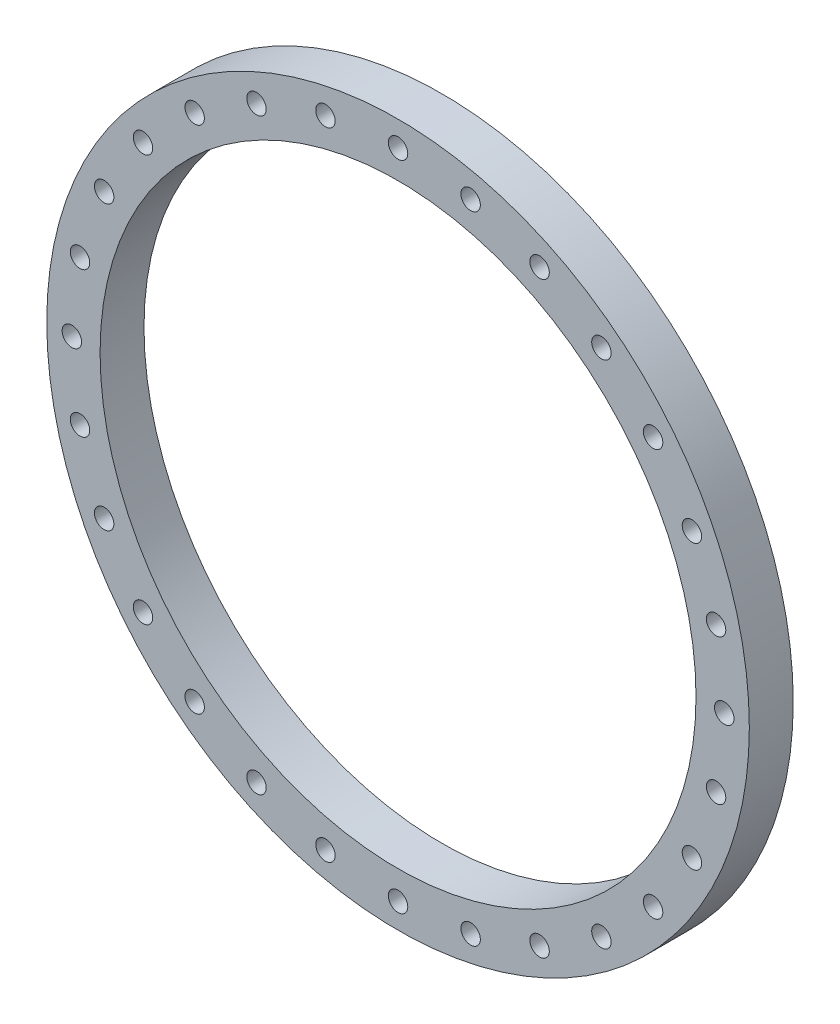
ISO-10303-21;
HEADER;
FILE_DESCRIPTION(('STEP AP214'),'2;1');
FILE_NAME('part.step','',(''),(''),'','','');
FILE_SCHEMA(('AUTOMOTIVE_DESIGN { 1 0 10303 214 1 1 1 1 }'));
ENDSEC;
DATA;
#1=APPLICATION_CONTEXT('core data for automotive mechanical design processes');
#2=APPLICATION_PROTOCOL_DEFINITION('international standard','automotive_design',2000,#1);
#3=PRODUCT_CONTEXT('',#1,'mechanical');
#4=PRODUCT('Part','Part','',(#3));
#5=PRODUCT_RELATED_PRODUCT_CATEGORY('part','',(#4));
#6=PRODUCT_DEFINITION_FORMATION('','',#4);
#7=PRODUCT_DEFINITION_CONTEXT('part definition',#1,'design');
#8=PRODUCT_DEFINITION('design','',#6,#7);
#9=PRODUCT_DEFINITION_SHAPE('','',#8);
#10=(LENGTH_UNIT() NAMED_UNIT(*) SI_UNIT(.MILLI.,.METRE.));
#11=(NAMED_UNIT(*) PLANE_ANGLE_UNIT() SI_UNIT($,.RADIAN.));
#12=(NAMED_UNIT(*) SI_UNIT($,.STERADIAN.) SOLID_ANGLE_UNIT());
#13=UNCERTAINTY_MEASURE_WITH_UNIT(LENGTH_MEASURE(1.E-05),#10,'distance_accuracy_value','');
#14=(GEOMETRIC_REPRESENTATION_CONTEXT(3) GLOBAL_UNCERTAINTY_ASSIGNED_CONTEXT((#13)) GLOBAL_UNIT_ASSIGNED_CONTEXT((#10,
#11,#12)) REPRESENTATION_CONTEXT('',''));
#15=CARTESIAN_POINT('',(0.,0.,0.));
#16=DIRECTION('',(0.,0.,1.));
#17=DIRECTION('',(1.,0.,0.));
#18=AXIS2_PLACEMENT_3D('',#15,#16,#17);
#19=CARTESIAN_POINT('',(0.,0.,0.));
#20=DIRECTION('',(0.,0.,1.));
#21=DIRECTION('',(1.,0.,0.));
#22=AXIS2_PLACEMENT_3D('',#19,#20,#21);
#23=PLANE('',#22);
#24=CARTESIAN_POINT('',(-11.5710885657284,50.6962514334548,0.));
#25=DIRECTION('',(0.,0.,1.));
#26=DIRECTION('',(1.,0.,0.));
#27=AXIS2_PLACEMENT_3D('',#24,#25,#26);
#28=CIRCLE('',#27,1.55);
#29=CARTESIAN_POINT('',(-10.0210885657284,50.6962514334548,0.));
#30=VERTEX_POINT('',#29);
#31=EDGE_CURVE('E169',#30,#30,#28,.T.);
#32=ORIENTED_EDGE('',*,*,#31,.T.);
#33=EDGE_LOOP('',(#32));
#34=FACE_BOUND('',#33,.T.);
#35=CARTESIAN_POINT('',(-22.5619544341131,46.8503811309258,0.));
#36=DIRECTION('',(0.,0.,1.));
#37=DIRECTION('',(1.,0.,0.));
#38=AXIS2_PLACEMENT_3D('',#35,#36,#37);
#39=CIRCLE('',#38,1.55);
#40=CARTESIAN_POINT('',(-21.0119544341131,46.8503811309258,0.));
#41=VERTEX_POINT('',#40);
#42=EDGE_CURVE('E184',#41,#41,#39,.T.);
#43=ORIENTED_EDGE('',*,*,#42,.T.);
#44=EDGE_LOOP('',(#43));
#45=FACE_BOUND('',#44,.T.);
#46=CARTESIAN_POINT('',(-32.4214696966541,40.6552370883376,0.));
#47=DIRECTION('',(0.,0.,1.));
#48=DIRECTION('',(1.,0.,0.));
#49=AXIS2_PLACEMENT_3D('',#46,#47,#48);
#50=CIRCLE('',#49,1.55);
#51=CARTESIAN_POINT('',(-30.8714696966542,40.6552370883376,0.));
#52=VERTEX_POINT('',#51);
#53=EDGE_CURVE('E192',#52,#52,#50,.T.);
#54=ORIENTED_EDGE('',*,*,#53,.T.);
#55=EDGE_LOOP('',(#54));
#56=FACE_BOUND('',#55,.T.);
#57=CARTESIAN_POINT('',(-40.6552370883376,32.4214696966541,0.));
#58=DIRECTION('',(0.,0.,1.));
#59=DIRECTION('',(1.,0.,0.));
#60=AXIS2_PLACEMENT_3D('',#57,#58,#59);
#61=CIRCLE('',#60,1.55);
#62=CARTESIAN_POINT('',(-39.1052370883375,32.4214696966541,0.));
#63=VERTEX_POINT('',#62);
#64=EDGE_CURVE('E203',#63,#63,#61,.T.);
#65=ORIENTED_EDGE('',*,*,#64,.T.);
#66=EDGE_LOOP('',(#65));
#67=FACE_BOUND('',#66,.T.);
#68=CARTESIAN_POINT('',(-46.8503811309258,22.561954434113,0.));
#69=DIRECTION('',(0.,0.,1.));
#70=DIRECTION('',(1.,0.,0.));
#71=AXIS2_PLACEMENT_3D('',#68,#69,#70);
#72=CIRCLE('',#71,1.55);
#73=CARTESIAN_POINT('',(-45.3003811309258,22.561954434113,0.));
#74=VERTEX_POINT('',#73);
#75=EDGE_CURVE('E214',#74,#74,#72,.T.);
#76=ORIENTED_EDGE('',*,*,#75,.T.);
#77=EDGE_LOOP('',(#76));
#78=FACE_BOUND('',#77,.T.);
#79=CARTESIAN_POINT('',(-50.6962514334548,11.5710885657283,0.));
#80=DIRECTION('',(0.,0.,1.));
#81=DIRECTION('',(1.,0.,0.));
#82=AXIS2_PLACEMENT_3D('',#79,#80,#81);
#83=CIRCLE('',#82,1.55);
#84=CARTESIAN_POINT('',(-49.1462514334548,11.5710885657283,0.));
#85=VERTEX_POINT('',#84);
#86=EDGE_CURVE('E234',#85,#85,#83,.T.);
#87=ORIENTED_EDGE('',*,*,#86,.T.);
#88=EDGE_LOOP('',(#87));
#89=FACE_BOUND('',#88,.T.);
#90=CARTESIAN_POINT('',(-52.,0.,0.));
#91=DIRECTION('',(0.,0.,1.));
#92=DIRECTION('',(1.,0.,0.));
#93=AXIS2_PLACEMENT_3D('',#90,#91,#92);
#94=CIRCLE('',#93,1.55);
#95=CARTESIAN_POINT('',(-50.45,0.,0.));
#96=VERTEX_POINT('',#95);
#97=EDGE_CURVE('E239',#96,#96,#94,.T.);
#98=ORIENTED_EDGE('',*,*,#97,.T.);
#99=EDGE_LOOP('',(#98));
#100=FACE_BOUND('',#99,.T.);
#101=CARTESIAN_POINT('',(-50.6962514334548,-11.5710885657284,0.));
#102=DIRECTION('',(0.,0.,1.));
#103=DIRECTION('',(1.,0.,0.));
#104=AXIS2_PLACEMENT_3D('',#101,#102,#103);
#105=CIRCLE('',#104,1.55);
#106=CARTESIAN_POINT('',(-49.1462514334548,-11.5710885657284,0.));
#107=VERTEX_POINT('',#106);
#108=EDGE_CURVE('E252',#107,#107,#105,.T.);
#109=ORIENTED_EDGE('',*,*,#108,.T.);
#110=EDGE_LOOP('',(#109));
#111=FACE_BOUND('',#110,.T.);
#112=CARTESIAN_POINT('',(-46.8503811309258,-22.5619544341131,0.));
#113=DIRECTION('',(0.,0.,1.));
#114=DIRECTION('',(1.,0.,0.));
#115=AXIS2_PLACEMENT_3D('',#112,#113,#114);
#116=CIRCLE('',#115,1.55);
#117=CARTESIAN_POINT('',(-45.3003811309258,-22.5619544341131,0.));
#118=VERTEX_POINT('',#117);
#119=EDGE_CURVE('E37',#118,#118,#116,.T.);
#120=ORIENTED_EDGE('',*,*,#119,.T.);
#121=EDGE_LOOP('',(#120));
#122=FACE_BOUND('',#121,.T.);
#123=CARTESIAN_POINT('',(-40.6552370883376,-32.4214696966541,0.));
#124=DIRECTION('',(0.,0.,1.));
#125=DIRECTION('',(1.,0.,0.));
#126=AXIS2_PLACEMENT_3D('',#123,#124,#125);
#127=CIRCLE('',#126,1.55);
#128=CARTESIAN_POINT('',(-39.1052370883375,-32.4214696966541,0.));
#129=VERTEX_POINT('',#128);
#130=EDGE_CURVE('E51',#129,#129,#127,.T.);
#131=ORIENTED_EDGE('',*,*,#130,.T.);
#132=EDGE_LOOP('',(#131));
#133=FACE_BOUND('',#132,.T.);
#134=CARTESIAN_POINT('',(-32.4214696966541,-40.6552370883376,0.));
#135=DIRECTION('',(0.,0.,1.));
#136=DIRECTION('',(1.,0.,0.));
#137=AXIS2_PLACEMENT_3D('',#134,#135,#136);
#138=CIRCLE('',#137,1.55);
#139=CARTESIAN_POINT('',(-30.8714696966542,-40.6552370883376,0.));
#140=VERTEX_POINT('',#139);
#141=EDGE_CURVE('E65',#140,#140,#138,.T.);
#142=ORIENTED_EDGE('',*,*,#141,.T.);
#143=EDGE_LOOP('',(#142));
#144=FACE_BOUND('',#143,.T.);
#145=CARTESIAN_POINT('',(-22.561954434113,-46.8503811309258,0.));
#146=DIRECTION('',(0.,0.,1.));
#147=DIRECTION('',(1.,0.,0.));
#148=AXIS2_PLACEMENT_3D('',#145,#146,#147);
#149=CIRCLE('',#148,1.55);
#150=CARTESIAN_POINT('',(-21.011954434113,-46.8503811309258,0.));
#151=VERTEX_POINT('',#150);
#152=EDGE_CURVE('E42',#151,#151,#149,.T.);
#153=ORIENTED_EDGE('',*,*,#152,.T.);
#154=EDGE_LOOP('',(#153));
#155=FACE_BOUND('',#154,.T.);
#156=CARTESIAN_POINT('',(-11.5710885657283,-50.6962514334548,0.));
#157=DIRECTION('',(0.,0.,1.));
#158=DIRECTION('',(1.,0.,0.));
#159=AXIS2_PLACEMENT_3D('',#156,#157,#158);
#160=CIRCLE('',#159,1.55);
#161=CARTESIAN_POINT('',(-10.0210885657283,-50.6962514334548,0.));
#162=VERTEX_POINT('',#161);
#163=EDGE_CURVE('E81',#162,#162,#160,.T.);
#164=ORIENTED_EDGE('',*,*,#163,.T.);
#165=EDGE_LOOP('',(#164));
#166=FACE_BOUND('',#165,.T.);
#167=CARTESIAN_POINT('',(0.,-52.,0.));
#168=DIRECTION('',(0.,0.,1.));
#169=DIRECTION('',(1.,0.,0.));
#170=AXIS2_PLACEMENT_3D('',#167,#168,#169);
#171=CIRCLE('',#170,1.55);
#172=CARTESIAN_POINT('',(1.55000000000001,-52.,0.));
#173=VERTEX_POINT('',#172);
#174=EDGE_CURVE('E86',#173,#173,#171,.T.);
#175=ORIENTED_EDGE('',*,*,#174,.T.);
#176=EDGE_LOOP('',(#175));
#177=FACE_BOUND('',#176,.T.);
#178=CARTESIAN_POINT('',(11.5710885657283,-50.6962514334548,0.));
#179=DIRECTION('',(0.,0.,1.));
#180=DIRECTION('',(1.,0.,0.));
#181=AXIS2_PLACEMENT_3D('',#178,#179,#180);
#182=CIRCLE('',#181,1.55);
#183=CARTESIAN_POINT('',(13.1210885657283,-50.6962514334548,0.));
#184=VERTEX_POINT('',#183);
#185=EDGE_CURVE('E91',#184,#184,#182,.T.);
#186=ORIENTED_EDGE('',*,*,#185,.T.);
#187=EDGE_LOOP('',(#186));
#188=FACE_BOUND('',#187,.T.);
#189=CARTESIAN_POINT('',(22.5619544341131,-46.8503811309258,0.));
#190=DIRECTION('',(0.,0.,1.));
#191=DIRECTION('',(1.,0.,0.));
#192=AXIS2_PLACEMENT_3D('',#189,#190,#191);
#193=CIRCLE('',#192,1.55);
#194=CARTESIAN_POINT('',(24.111954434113,-46.8503811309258,0.));
#195=VERTEX_POINT('',#194);
#196=EDGE_CURVE('E107',#195,#195,#193,.T.);
#197=ORIENTED_EDGE('',*,*,#196,.T.);
#198=EDGE_LOOP('',(#197));
#199=FACE_BOUND('',#198,.T.);
#200=CARTESIAN_POINT('',(32.4214696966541,-40.6552370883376,0.));
#201=DIRECTION('',(0.,0.,1.));
#202=DIRECTION('',(1.,0.,0.));
#203=AXIS2_PLACEMENT_3D('',#200,#201,#202);
#204=CIRCLE('',#203,1.55);
#205=CARTESIAN_POINT('',(33.9714696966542,-40.6552370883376,0.));
#206=VERTEX_POINT('',#205);
#207=EDGE_CURVE('E106',#206,#206,#204,.T.);
#208=ORIENTED_EDGE('',*,*,#207,.T.);
#209=EDGE_LOOP('',(#208));
#210=FACE_BOUND('',#209,.T.);
#211=CARTESIAN_POINT('',(40.6552370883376,-32.4214696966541,0.));
#212=DIRECTION('',(0.,0.,1.));
#213=DIRECTION('',(1.,0.,0.));
#214=AXIS2_PLACEMENT_3D('',#211,#212,#213);
#215=CIRCLE('',#214,1.55);
#216=CARTESIAN_POINT('',(42.2052370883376,-32.4214696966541,0.));
#217=VERTEX_POINT('',#216);
#218=EDGE_CURVE('E112',#217,#217,#215,.T.);
#219=ORIENTED_EDGE('',*,*,#218,.T.);
#220=EDGE_LOOP('',(#219));
#221=FACE_BOUND('',#220,.T.);
#222=CARTESIAN_POINT('',(46.8503811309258,-22.561954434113,0.));
#223=DIRECTION('',(0.,0.,1.));
#224=DIRECTION('',(1.,0.,0.));
#225=AXIS2_PLACEMENT_3D('',#222,#223,#224);
#226=CIRCLE('',#225,1.55);
#227=CARTESIAN_POINT('',(48.4003811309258,-22.561954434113,0.));
#228=VERTEX_POINT('',#227);
#229=EDGE_CURVE('E117',#228,#228,#226,.T.);
#230=ORIENTED_EDGE('',*,*,#229,.T.);
#231=EDGE_LOOP('',(#230));
#232=FACE_BOUND('',#231,.T.);
#233=CARTESIAN_POINT('',(50.6962514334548,-11.5710885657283,0.));
#234=DIRECTION('',(0.,0.,1.));
#235=DIRECTION('',(1.,0.,0.));
#236=AXIS2_PLACEMENT_3D('',#233,#234,#235);
#237=CIRCLE('',#236,1.55);
#238=CARTESIAN_POINT('',(52.2462514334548,-11.5710885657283,0.));
#239=VERTEX_POINT('',#238);
#240=EDGE_CURVE('E128',#239,#239,#237,.T.);
#241=ORIENTED_EDGE('',*,*,#240,.T.);
#242=EDGE_LOOP('',(#241));
#243=FACE_BOUND('',#242,.T.);
#244=CARTESIAN_POINT('',(52.,0.,0.));
#245=DIRECTION('',(0.,0.,1.));
#246=DIRECTION('',(1.,0.,0.));
#247=AXIS2_PLACEMENT_3D('',#244,#245,#246);
#248=CIRCLE('',#247,1.55);
#249=CARTESIAN_POINT('',(53.55,0.,0.));
#250=VERTEX_POINT('',#249);
#251=EDGE_CURVE('E136',#250,#250,#248,.T.);
#252=ORIENTED_EDGE('',*,*,#251,.T.);
#253=EDGE_LOOP('',(#252));
#254=FACE_BOUND('',#253,.T.);
#255=CARTESIAN_POINT('',(50.6962514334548,11.5710885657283,0.));
#256=DIRECTION('',(0.,0.,1.));
#257=DIRECTION('',(1.,0.,0.));
#258=AXIS2_PLACEMENT_3D('',#255,#256,#257);
#259=CIRCLE('',#258,1.55);
#260=CARTESIAN_POINT('',(52.2462514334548,11.5710885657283,0.));
#261=VERTEX_POINT('',#260);
#262=EDGE_CURVE('E66',#261,#261,#259,.T.);
#263=ORIENTED_EDGE('',*,*,#262,.T.);
#264=EDGE_LOOP('',(#263));
#265=FACE_BOUND('',#264,.T.);
#266=CARTESIAN_POINT('',(46.8503811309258,22.561954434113,0.));
#267=DIRECTION('',(0.,0.,1.));
#268=DIRECTION('',(1.,0.,0.));
#269=AXIS2_PLACEMENT_3D('',#266,#267,#268);
#270=CIRCLE('',#269,1.55);
#271=CARTESIAN_POINT('',(48.4003811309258,22.561954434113,0.));
#272=VERTEX_POINT('',#271);
#273=EDGE_CURVE('E57',#272,#272,#270,.T.);
#274=ORIENTED_EDGE('',*,*,#273,.T.);
#275=EDGE_LOOP('',(#274));
#276=FACE_BOUND('',#275,.T.);
#277=CARTESIAN_POINT('',(40.6552370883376,32.4214696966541,0.));
#278=DIRECTION('',(0.,0.,1.));
#279=DIRECTION('',(1.,0.,0.));
#280=AXIS2_PLACEMENT_3D('',#277,#278,#279);
#281=CIRCLE('',#280,1.55);
#282=CARTESIAN_POINT('',(42.2052370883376,32.4214696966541,0.));
#283=VERTEX_POINT('',#282);
#284=EDGE_CURVE('E56',#283,#283,#281,.T.);
#285=ORIENTED_EDGE('',*,*,#284,.T.);
#286=EDGE_LOOP('',(#285));
#287=FACE_BOUND('',#286,.T.);
#288=CARTESIAN_POINT('',(32.4214696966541,40.6552370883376,0.));
#289=DIRECTION('',(0.,0.,1.));
#290=DIRECTION('',(1.,0.,0.));
#291=AXIS2_PLACEMENT_3D('',#288,#289,#290);
#292=CIRCLE('',#291,1.55);
#293=CARTESIAN_POINT('',(33.9714696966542,40.6552370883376,0.));
#294=VERTEX_POINT('',#293);
#295=EDGE_CURVE('E122',#294,#294,#292,.T.);
#296=ORIENTED_EDGE('',*,*,#295,.T.);
#297=EDGE_LOOP('',(#296));
#298=FACE_BOUND('',#297,.T.);
#299=CARTESIAN_POINT('',(22.561954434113,46.8503811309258,0.));
#300=DIRECTION('',(0.,0.,1.));
#301=DIRECTION('',(1.,0.,0.));
#302=AXIS2_PLACEMENT_3D('',#299,#300,#301);
#303=CIRCLE('',#302,1.55);
#304=CARTESIAN_POINT('',(24.111954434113,46.8503811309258,0.));
#305=VERTEX_POINT('',#304);
#306=EDGE_CURVE('E140',#305,#305,#303,.T.);
#307=ORIENTED_EDGE('',*,*,#306,.T.);
#308=EDGE_LOOP('',(#307));
#309=FACE_BOUND('',#308,.T.);
#310=CARTESIAN_POINT('',(11.5710885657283,50.6962514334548,0.));
#311=DIRECTION('',(0.,0.,1.));
#312=DIRECTION('',(1.,0.,0.));
#313=AXIS2_PLACEMENT_3D('',#310,#311,#312);
#314=CIRCLE('',#313,1.55);
#315=CARTESIAN_POINT('',(13.1210885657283,50.6962514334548,0.));
#316=VERTEX_POINT('',#315);
#317=EDGE_CURVE('E153',#316,#316,#314,.T.);
#318=ORIENTED_EDGE('',*,*,#317,.T.);
#319=EDGE_LOOP('',(#318));
#320=FACE_BOUND('',#319,.T.);
#321=CARTESIAN_POINT('',(0.,52.,0.));
#322=DIRECTION('',(0.,0.,1.));
#323=DIRECTION('',(1.,0.,0.));
#324=AXIS2_PLACEMENT_3D('',#321,#322,#323);
#325=CIRCLE('',#324,1.55);
#326=CARTESIAN_POINT('',(1.55,52.,0.));
#327=VERTEX_POINT('',#326);
#328=EDGE_CURVE('E96',#327,#327,#325,.T.);
#329=ORIENTED_EDGE('',*,*,#328,.T.);
#330=EDGE_LOOP('',(#329));
#331=FACE_BOUND('',#330,.T.);
#332=CARTESIAN_POINT('',(0.,0.,0.));
#333=DIRECTION('',(0.,0.,1.));
#334=DIRECTION('',(1.,0.,0.));
#335=AXIS2_PLACEMENT_3D('',#332,#333,#334);
#336=CIRCLE('',#335,47.5);
#337=CARTESIAN_POINT('',(47.5,0.,0.));
#338=VERTEX_POINT('',#337);
#339=EDGE_CURVE('E32',#338,#338,#336,.T.);
#340=ORIENTED_EDGE('',*,*,#339,.T.);
#341=EDGE_LOOP('',(#340));
#342=FACE_BOUND('',#341,.T.);
#343=CARTESIAN_POINT('',(0.,0.,0.));
#344=DIRECTION('',(0.,0.,1.));
#345=DIRECTION('',(1.,0.,0.));
#346=AXIS2_PLACEMENT_3D('',#343,#344,#345);
#347=CIRCLE('',#346,56.);
#348=CARTESIAN_POINT('',(56.,0.,0.));
#349=VERTEX_POINT('',#348);
#350=EDGE_CURVE('E10',#349,#349,#347,.T.);
#351=ORIENTED_EDGE('',*,*,#350,.F.);
#352=EDGE_LOOP('',(#351));
#353=FACE_BOUND('',#352,.T.);
#354=ADVANCED_FACE('F15',(#34,#45,#56,#67,#78,#89,#100,#111,#122,#133,#144,#155,#166,#177,#188,
#199,#210,#221,#232,#243,#254,#265,#276,#287,#298,#309,#320,#331,#342,#353),#23,.F.);
#355=CARTESIAN_POINT('',(0.,0.,7.));
#356=DIRECTION('',(0.,0.,1.));
#357=DIRECTION('',(1.,0.,0.));
#358=AXIS2_PLACEMENT_3D('',#355,#356,#357);
#359=PLANE('',#358);
#360=CARTESIAN_POINT('',(-11.5710885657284,50.6962514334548,7.));
#361=DIRECTION('',(0.,0.,1.));
#362=DIRECTION('',(1.,0.,0.));
#363=AXIS2_PLACEMENT_3D('',#360,#361,#362);
#364=CIRCLE('',#363,1.55);
#365=CARTESIAN_POINT('',(-10.0210885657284,50.6962514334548,7.));
#366=VERTEX_POINT('',#365);
#367=EDGE_CURVE('E1209',#366,#366,#364,.T.);
#368=ORIENTED_EDGE('',*,*,#367,.F.);
#369=EDGE_LOOP('',(#368));
#370=FACE_BOUND('',#369,.T.);
#371=CARTESIAN_POINT('',(-32.4214696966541,40.6552370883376,7.));
#372=DIRECTION('',(0.,0.,1.));
#373=DIRECTION('',(1.,0.,0.));
#374=AXIS2_PLACEMENT_3D('',#371,#372,#373);
#375=CIRCLE('',#374,1.55);
#376=CARTESIAN_POINT('',(-30.8714696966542,40.6552370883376,7.));
#377=VERTEX_POINT('',#376);
#378=EDGE_CURVE('E188',#377,#377,#375,.T.);
#379=ORIENTED_EDGE('',*,*,#378,.F.);
#380=EDGE_LOOP('',(#379));
#381=FACE_BOUND('',#380,.T.);
#382=CARTESIAN_POINT('',(-46.8503811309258,22.561954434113,7.));
#383=DIRECTION('',(0.,0.,1.));
#384=DIRECTION('',(1.,0.,0.));
#385=AXIS2_PLACEMENT_3D('',#382,#383,#384);
#386=CIRCLE('',#385,1.55);
#387=CARTESIAN_POINT('',(-45.3003811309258,22.561954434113,7.));
#388=VERTEX_POINT('',#387);
#389=EDGE_CURVE('E207',#388,#388,#386,.T.);
#390=ORIENTED_EDGE('',*,*,#389,.F.);
#391=EDGE_LOOP('',(#390));
#392=FACE_BOUND('',#391,.T.);
#393=CARTESIAN_POINT('',(-52.,0.,7.));
#394=DIRECTION('',(0.,0.,1.));
#395=DIRECTION('',(1.,0.,0.));
#396=AXIS2_PLACEMENT_3D('',#393,#394,#395);
#397=CIRCLE('',#396,1.55);
#398=CARTESIAN_POINT('',(-50.45,0.,7.));
#399=VERTEX_POINT('',#398);
#400=EDGE_CURVE('E235',#399,#399,#397,.T.);
#401=ORIENTED_EDGE('',*,*,#400,.F.);
#402=EDGE_LOOP('',(#401));
#403=FACE_BOUND('',#402,.T.);
#404=CARTESIAN_POINT('',(-46.8503811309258,-22.5619544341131,7.));
#405=DIRECTION('',(0.,0.,1.));
#406=DIRECTION('',(1.,0.,0.));
#407=AXIS2_PLACEMENT_3D('',#404,#405,#406);
#408=CIRCLE('',#407,1.55);
#409=CARTESIAN_POINT('',(-45.3003811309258,-22.5619544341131,7.));
#410=VERTEX_POINT('',#409);
#411=EDGE_CURVE('E35',#410,#410,#408,.T.);
#412=ORIENTED_EDGE('',*,*,#411,.F.);
#413=EDGE_LOOP('',(#412));
#414=FACE_BOUND('',#413,.T.);
#415=CARTESIAN_POINT('',(-32.4214696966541,-40.6552370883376,7.));
#416=DIRECTION('',(0.,0.,1.));
#417=DIRECTION('',(1.,0.,0.));
#418=AXIS2_PLACEMENT_3D('',#415,#416,#417);
#419=CIRCLE('',#418,1.55);
#420=CARTESIAN_POINT('',(-30.8714696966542,-40.6552370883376,7.));
#421=VERTEX_POINT('',#420);
#422=EDGE_CURVE('E61',#421,#421,#419,.T.);
#423=ORIENTED_EDGE('',*,*,#422,.F.);
#424=EDGE_LOOP('',(#423));
#425=FACE_BOUND('',#424,.T.);
#426=CARTESIAN_POINT('',(-11.5710885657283,-50.6962514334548,7.));
#427=DIRECTION('',(0.,0.,1.));
#428=DIRECTION('',(1.,0.,0.));
#429=AXIS2_PLACEMENT_3D('',#426,#427,#428);
#430=CIRCLE('',#429,1.55);
#431=CARTESIAN_POINT('',(-10.0210885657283,-50.6962514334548,7.));
#432=VERTEX_POINT('',#431);
#433=EDGE_CURVE('E46',#432,#432,#430,.T.);
#434=ORIENTED_EDGE('',*,*,#433,.F.);
#435=EDGE_LOOP('',(#434));
#436=FACE_BOUND('',#435,.T.);
#437=CARTESIAN_POINT('',(11.5710885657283,-50.6962514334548,7.));
#438=DIRECTION('',(0.,0.,1.));
#439=DIRECTION('',(1.,0.,0.));
#440=AXIS2_PLACEMENT_3D('',#437,#438,#439);
#441=CIRCLE('',#440,1.55);
#442=CARTESIAN_POINT('',(13.1210885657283,-50.6962514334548,7.));
#443=VERTEX_POINT('',#442);
#444=EDGE_CURVE('E87',#443,#443,#441,.T.);
#445=ORIENTED_EDGE('',*,*,#444,.F.);
#446=EDGE_LOOP('',(#445));
#447=FACE_BOUND('',#446,.T.);
#448=CARTESIAN_POINT('',(32.4214696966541,-40.6552370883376,7.));
#449=DIRECTION('',(0.,0.,1.));
#450=DIRECTION('',(1.,0.,0.));
#451=AXIS2_PLACEMENT_3D('',#448,#449,#450);
#452=CIRCLE('',#451,1.55);
#453=CARTESIAN_POINT('',(33.9714696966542,-40.6552370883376,7.));
#454=VERTEX_POINT('',#453);
#455=EDGE_CURVE('E102',#454,#454,#452,.T.);
#456=ORIENTED_EDGE('',*,*,#455,.F.);
#457=EDGE_LOOP('',(#456));
#458=FACE_BOUND('',#457,.T.);
#459=CARTESIAN_POINT('',(46.8503811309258,-22.561954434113,7.));
#460=DIRECTION('',(0.,0.,1.));
#461=DIRECTION('',(1.,0.,0.));
#462=AXIS2_PLACEMENT_3D('',#459,#460,#461);
#463=CIRCLE('',#462,1.55);
#464=CARTESIAN_POINT('',(48.4003811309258,-22.561954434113,7.));
#465=VERTEX_POINT('',#464);
#466=EDGE_CURVE('E113',#465,#465,#463,.T.);
#467=ORIENTED_EDGE('',*,*,#466,.F.);
#468=EDGE_LOOP('',(#467));
#469=FACE_BOUND('',#468,.T.);
#470=CARTESIAN_POINT('',(52.,0.,7.));
#471=DIRECTION('',(0.,0.,1.));
#472=DIRECTION('',(1.,0.,0.));
#473=AXIS2_PLACEMENT_3D('',#470,#471,#472);
#474=CIRCLE('',#473,1.55);
#475=CARTESIAN_POINT('',(53.55,0.,7.));
#476=VERTEX_POINT('',#475);
#477=EDGE_CURVE('E132',#476,#476,#474,.T.);
#478=ORIENTED_EDGE('',*,*,#477,.F.);
#479=EDGE_LOOP('',(#478));
#480=FACE_BOUND('',#479,.T.);
#481=CARTESIAN_POINT('',(46.8503811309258,22.561954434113,7.));
#482=DIRECTION('',(0.,0.,1.));
#483=DIRECTION('',(1.,0.,0.));
#484=AXIS2_PLACEMENT_3D('',#481,#482,#483);
#485=CIRCLE('',#484,1.55);
#486=CARTESIAN_POINT('',(48.4003811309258,22.561954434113,7.));
#487=VERTEX_POINT('',#486);
#488=EDGE_CURVE('E70',#487,#487,#485,.T.);
#489=ORIENTED_EDGE('',*,*,#488,.F.);
#490=EDGE_LOOP('',(#489));
#491=FACE_BOUND('',#490,.T.);
#492=CARTESIAN_POINT('',(32.4214696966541,40.6552370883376,7.));
#493=DIRECTION('',(0.,0.,1.));
#494=DIRECTION('',(1.,0.,0.));
#495=AXIS2_PLACEMENT_3D('',#492,#493,#494);
#496=CIRCLE('',#495,1.55);
#497=CARTESIAN_POINT('',(33.9714696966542,40.6552370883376,7.));
#498=VERTEX_POINT('',#497);
#499=EDGE_CURVE('E127',#498,#498,#496,.T.);
#500=ORIENTED_EDGE('',*,*,#499,.F.);
#501=EDGE_LOOP('',(#500));
#502=FACE_BOUND('',#501,.T.);
#503=CARTESIAN_POINT('',(11.5710885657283,50.6962514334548,7.));
#504=DIRECTION('',(0.,0.,1.));
#505=DIRECTION('',(1.,0.,0.));
#506=AXIS2_PLACEMENT_3D('',#503,#504,#505);
#507=CIRCLE('',#506,1.55);
#508=CARTESIAN_POINT('',(13.1210885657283,50.6962514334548,7.));
#509=VERTEX_POINT('',#508);
#510=EDGE_CURVE('E144',#509,#509,#507,.T.);
#511=ORIENTED_EDGE('',*,*,#510,.F.);
#512=EDGE_LOOP('',(#511));
#513=FACE_BOUND('',#512,.T.);
#514=CARTESIAN_POINT('',(0.,0.,7.));
#515=DIRECTION('',(0.,0.,1.));
#516=DIRECTION('',(1.,0.,0.));
#517=AXIS2_PLACEMENT_3D('',#514,#515,#516);
#518=CIRCLE('',#517,47.5);
#519=CARTESIAN_POINT('',(47.5,0.,7.));
#520=VERTEX_POINT('',#519);
#521=EDGE_CURVE('E100',#520,#520,#518,.T.);
#522=ORIENTED_EDGE('',*,*,#521,.F.);
#523=EDGE_LOOP('',(#522));
#524=FACE_BOUND('',#523,.T.);
#525=CARTESIAN_POINT('',(0.,52.,7.));
#526=DIRECTION('',(0.,0.,1.));
#527=DIRECTION('',(1.,0.,0.));
#528=AXIS2_PLACEMENT_3D('',#525,#526,#527);
#529=CIRCLE('',#528,1.55);
#530=CARTESIAN_POINT('',(1.55,52.,7.));
#531=VERTEX_POINT('',#530);
#532=EDGE_CURVE('E101',#531,#531,#529,.T.);
#533=ORIENTED_EDGE('',*,*,#532,.F.);
#534=EDGE_LOOP('',(#533));
#535=FACE_BOUND('',#534,.T.);
#536=CARTESIAN_POINT('',(22.561954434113,46.8503811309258,7.));
#537=DIRECTION('',(0.,0.,1.));
#538=DIRECTION('',(1.,0.,0.));
#539=AXIS2_PLACEMENT_3D('',#536,#537,#538);
#540=CIRCLE('',#539,1.55);
#541=CARTESIAN_POINT('',(24.111954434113,46.8503811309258,7.));
#542=VERTEX_POINT('',#541);
#543=EDGE_CURVE('E126',#542,#542,#540,.T.);
#544=ORIENTED_EDGE('',*,*,#543,.F.);
#545=EDGE_LOOP('',(#544));
#546=FACE_BOUND('',#545,.T.);
#547=CARTESIAN_POINT('',(40.6552370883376,32.4214696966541,7.));
#548=DIRECTION('',(0.,0.,1.));
#549=DIRECTION('',(1.,0.,0.));
#550=AXIS2_PLACEMENT_3D('',#547,#548,#549);
#551=CIRCLE('',#550,1.55);
#552=CARTESIAN_POINT('',(42.2052370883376,32.4214696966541,7.));
#553=VERTEX_POINT('',#552);
#554=EDGE_CURVE('E52',#553,#553,#551,.T.);
#555=ORIENTED_EDGE('',*,*,#554,.F.);
#556=EDGE_LOOP('',(#555));
#557=FACE_BOUND('',#556,.T.);
#558=CARTESIAN_POINT('',(50.6962514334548,11.5710885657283,7.));
#559=DIRECTION('',(0.,0.,1.));
#560=DIRECTION('',(1.,0.,0.));
#561=AXIS2_PLACEMENT_3D('',#558,#559,#560);
#562=CIRCLE('',#561,1.55);
#563=CARTESIAN_POINT('',(52.2462514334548,11.5710885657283,7.));
#564=VERTEX_POINT('',#563);
#565=EDGE_CURVE('E71',#564,#564,#562,.T.);
#566=ORIENTED_EDGE('',*,*,#565,.F.);
#567=EDGE_LOOP('',(#566));
#568=FACE_BOUND('',#567,.T.);
#569=CARTESIAN_POINT('',(50.6962514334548,-11.5710885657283,7.));
#570=DIRECTION('',(0.,0.,1.));
#571=DIRECTION('',(1.,0.,0.));
#572=AXIS2_PLACEMENT_3D('',#569,#570,#571);
#573=CIRCLE('',#572,1.55);
#574=CARTESIAN_POINT('',(52.2462514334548,-11.5710885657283,7.));
#575=VERTEX_POINT('',#574);
#576=EDGE_CURVE('E121',#575,#575,#573,.T.);
#577=ORIENTED_EDGE('',*,*,#576,.F.);
#578=EDGE_LOOP('',(#577));
#579=FACE_BOUND('',#578,.T.);
#580=CARTESIAN_POINT('',(40.6552370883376,-32.4214696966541,7.));
#581=DIRECTION('',(0.,0.,1.));
#582=DIRECTION('',(1.,0.,0.));
#583=AXIS2_PLACEMENT_3D('',#580,#581,#582);
#584=CIRCLE('',#583,1.55);
#585=CARTESIAN_POINT('',(42.2052370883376,-32.4214696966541,7.));
#586=VERTEX_POINT('',#585);
#587=EDGE_CURVE('E108',#586,#586,#584,.T.);
#588=ORIENTED_EDGE('',*,*,#587,.F.);
#589=EDGE_LOOP('',(#588));
#590=FACE_BOUND('',#589,.T.);
#591=CARTESIAN_POINT('',(22.5619544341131,-46.8503811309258,7.));
#592=DIRECTION('',(0.,0.,1.));
#593=DIRECTION('',(1.,0.,0.));
#594=AXIS2_PLACEMENT_3D('',#591,#592,#593);
#595=CIRCLE('',#594,1.55);
#596=CARTESIAN_POINT('',(24.111954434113,-46.8503811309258,7.));
#597=VERTEX_POINT('',#596);
#598=EDGE_CURVE('E95',#597,#597,#595,.T.);
#599=ORIENTED_EDGE('',*,*,#598,.F.);
#600=EDGE_LOOP('',(#599));
#601=FACE_BOUND('',#600,.T.);
#602=CARTESIAN_POINT('',(0.,-52.,7.));
#603=DIRECTION('',(0.,0.,1.));
#604=DIRECTION('',(1.,0.,0.));
#605=AXIS2_PLACEMENT_3D('',#602,#603,#604);
#606=CIRCLE('',#605,1.55);
#607=CARTESIAN_POINT('',(1.55000000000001,-52.,7.));
#608=VERTEX_POINT('',#607);
#609=EDGE_CURVE('E82',#608,#608,#606,.T.);
#610=ORIENTED_EDGE('',*,*,#609,.F.);
#611=EDGE_LOOP('',(#610));
#612=FACE_BOUND('',#611,.T.);
#613=CARTESIAN_POINT('',(-22.561954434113,-46.8503811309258,7.));
#614=DIRECTION('',(0.,0.,1.));
#615=DIRECTION('',(1.,0.,0.));
#616=AXIS2_PLACEMENT_3D('',#613,#614,#615);
#617=CIRCLE('',#616,1.55);
#618=CARTESIAN_POINT('',(-21.011954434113,-46.8503811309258,7.));
#619=VERTEX_POINT('',#618);
#620=EDGE_CURVE('E47',#619,#619,#617,.T.);
#621=ORIENTED_EDGE('',*,*,#620,.F.);
#622=EDGE_LOOP('',(#621));
#623=FACE_BOUND('',#622,.T.);
#624=CARTESIAN_POINT('',(-40.6552370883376,-32.4214696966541,7.));
#625=DIRECTION('',(0.,0.,1.));
#626=DIRECTION('',(1.,0.,0.));
#627=AXIS2_PLACEMENT_3D('',#624,#625,#626);
#628=CIRCLE('',#627,1.55);
#629=CARTESIAN_POINT('',(-39.1052370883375,-32.4214696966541,7.));
#630=VERTEX_POINT('',#629);
#631=EDGE_CURVE('E41',#630,#630,#628,.T.);
#632=ORIENTED_EDGE('',*,*,#631,.F.);
#633=EDGE_LOOP('',(#632));
#634=FACE_BOUND('',#633,.T.);
#635=CARTESIAN_POINT('',(-50.6962514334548,-11.5710885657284,7.));
#636=DIRECTION('',(0.,0.,1.));
#637=DIRECTION('',(1.,0.,0.));
#638=AXIS2_PLACEMENT_3D('',#635,#636,#637);
#639=CIRCLE('',#638,1.55);
#640=CARTESIAN_POINT('',(-49.1462514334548,-11.5710885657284,7.));
#641=VERTEX_POINT('',#640);
#642=EDGE_CURVE('E249',#641,#641,#639,.T.);
#643=ORIENTED_EDGE('',*,*,#642,.F.);
#644=EDGE_LOOP('',(#643));
#645=FACE_BOUND('',#644,.T.);
#646=CARTESIAN_POINT('',(-50.6962514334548,11.5710885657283,7.));
#647=DIRECTION('',(0.,0.,1.));
#648=DIRECTION('',(1.,0.,0.));
#649=AXIS2_PLACEMENT_3D('',#646,#647,#648);
#650=CIRCLE('',#649,1.55);
#651=CARTESIAN_POINT('',(-49.1462514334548,11.5710885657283,7.));
#652=VERTEX_POINT('',#651);
#653=EDGE_CURVE('E230',#652,#652,#650,.T.);
#654=ORIENTED_EDGE('',*,*,#653,.F.);
#655=EDGE_LOOP('',(#654));
#656=FACE_BOUND('',#655,.T.);
#657=CARTESIAN_POINT('',(-40.6552370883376,32.4214696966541,7.));
#658=DIRECTION('',(0.,0.,1.));
#659=DIRECTION('',(1.,0.,0.));
#660=AXIS2_PLACEMENT_3D('',#657,#658,#659);
#661=CIRCLE('',#660,1.55);
#662=CARTESIAN_POINT('',(-39.1052370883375,32.4214696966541,7.));
#663=VERTEX_POINT('',#662);
#664=EDGE_CURVE('E196',#663,#663,#661,.T.);
#665=ORIENTED_EDGE('',*,*,#664,.F.);
#666=EDGE_LOOP('',(#665));
#667=FACE_BOUND('',#666,.T.);
#668=CARTESIAN_POINT('',(-22.5619544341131,46.8503811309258,7.));
#669=DIRECTION('',(0.,0.,1.));
#670=DIRECTION('',(1.,0.,0.));
#671=AXIS2_PLACEMENT_3D('',#668,#669,#670);
#672=CIRCLE('',#671,1.55);
#673=CARTESIAN_POINT('',(-21.0119544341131,46.8503811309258,7.));
#674=VERTEX_POINT('',#673);
#675=EDGE_CURVE('E180',#674,#674,#672,.T.);
#676=ORIENTED_EDGE('',*,*,#675,.F.);
#677=EDGE_LOOP('',(#676));
#678=FACE_BOUND('',#677,.T.);
#679=CARTESIAN_POINT('',(0.,0.,7.));
#680=DIRECTION('',(0.,0.,1.));
#681=DIRECTION('',(1.,0.,0.));
#682=AXIS2_PLACEMENT_3D('',#679,#680,#681);
#683=CIRCLE('',#682,56.);
#684=CARTESIAN_POINT('',(56.,0.,7.));
#685=VERTEX_POINT('',#684);
#686=EDGE_CURVE('E18',#685,#685,#683,.T.);
#687=ORIENTED_EDGE('',*,*,#686,.T.);
#688=EDGE_LOOP('',(#687));
#689=FACE_BOUND('',#688,.T.);
#690=ADVANCED_FACE('F267',(#370,#381,#392,#403,#414,#425,#436,#447,#458,#469,#480,#491,#502,
#513,#524,#535,#546,#557,#568,#579,#590,#601,#612,#623,#634,#645,#656,#667,#678,#689),#359,.T.);
#691=CARTESIAN_POINT('',(0.,0.,7.));
#692=DIRECTION('',(0.,0.,-1.));
#693=DIRECTION('',(-1.,0.,0.));
#694=AXIS2_PLACEMENT_3D('',#691,#692,#693);
#695=CYLINDRICAL_SURFACE('',#694,56.);
#696=ORIENTED_EDGE('',*,*,#350,.T.);
#697=EDGE_LOOP('',(#696));
#698=FACE_BOUND('',#697,.T.);
#699=ORIENTED_EDGE('',*,*,#686,.F.);
#700=EDGE_LOOP('',(#699));
#701=FACE_BOUND('',#700,.T.);
#702=ADVANCED_FACE('F270',(#698,#701),#695,.T.);
#703=CARTESIAN_POINT('',(0.,0.,7.));
#704=DIRECTION('',(0.,0.,-1.));
#705=DIRECTION('',(-1.,0.,0.));
#706=AXIS2_PLACEMENT_3D('',#703,#704,#705);
#707=CYLINDRICAL_SURFACE('',#706,47.5);
#708=ORIENTED_EDGE('',*,*,#339,.F.);
#709=EDGE_LOOP('',(#708));
#710=FACE_BOUND('',#709,.T.);
#711=ORIENTED_EDGE('',*,*,#521,.T.);
#712=EDGE_LOOP('',(#711));
#713=FACE_BOUND('',#712,.T.);
#714=ADVANCED_FACE('F324',(#710,#713),#707,.F.);
#715=CARTESIAN_POINT('',(0.,52.,7.));
#716=DIRECTION('',(0.,0.,-1.));
#717=DIRECTION('',(-1.,0.,0.));
#718=AXIS2_PLACEMENT_3D('',#715,#716,#717);
#719=CYLINDRICAL_SURFACE('',#718,1.55);
#720=ORIENTED_EDGE('',*,*,#328,.F.);
#721=EDGE_LOOP('',(#720));
#722=FACE_BOUND('',#721,.T.);
#723=ORIENTED_EDGE('',*,*,#532,.T.);
#724=EDGE_LOOP('',(#723));
#725=FACE_BOUND('',#724,.T.);
#726=ADVANCED_FACE('F330',(#722,#725),#719,.F.);
#727=CARTESIAN_POINT('',(11.5710885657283,50.6962514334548,7.));
#728=DIRECTION('',(0.,0.,-1.));
#729=DIRECTION('',(-1.,0.,0.));
#730=AXIS2_PLACEMENT_3D('',#727,#728,#729);
#731=CYLINDRICAL_SURFACE('',#730,1.55);
#732=ORIENTED_EDGE('',*,*,#317,.F.);
#733=EDGE_LOOP('',(#732));
#734=FACE_BOUND('',#733,.T.);
#735=ORIENTED_EDGE('',*,*,#510,.T.);
#736=EDGE_LOOP('',(#735));
#737=FACE_BOUND('',#736,.T.);
#738=ADVANCED_FACE('F396',(#734,#737),#731,.F.);
#739=CARTESIAN_POINT('',(22.561954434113,46.8503811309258,7.));
#740=DIRECTION('',(0.,0.,-1.));
#741=DIRECTION('',(-1.,0.,0.));
#742=AXIS2_PLACEMENT_3D('',#739,#740,#741);
#743=CYLINDRICAL_SURFACE('',#742,1.55);
#744=ORIENTED_EDGE('',*,*,#306,.F.);
#745=EDGE_LOOP('',(#744));
#746=FACE_BOUND('',#745,.T.);
#747=ORIENTED_EDGE('',*,*,#543,.T.);
#748=EDGE_LOOP('',(#747));
#749=FACE_BOUND('',#748,.T.);
#750=ADVANCED_FACE('F401',(#746,#749),#743,.F.);
#751=CARTESIAN_POINT('',(32.4214696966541,40.6552370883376,7.));
#752=DIRECTION('',(0.,0.,-1.));
#753=DIRECTION('',(-1.,0.,0.));
#754=AXIS2_PLACEMENT_3D('',#751,#752,#753);
#755=CYLINDRICAL_SURFACE('',#754,1.55);
#756=ORIENTED_EDGE('',*,*,#295,.F.);
#757=EDGE_LOOP('',(#756));
#758=FACE_BOUND('',#757,.T.);
#759=ORIENTED_EDGE('',*,*,#499,.T.);
#760=EDGE_LOOP('',(#759));
#761=FACE_BOUND('',#760,.T.);
#762=ADVANCED_FACE('F407',(#758,#761),#755,.F.);
#763=CARTESIAN_POINT('',(40.6552370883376,32.4214696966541,7.));
#764=DIRECTION('',(0.,0.,-1.));
#765=DIRECTION('',(-1.,0.,0.));
#766=AXIS2_PLACEMENT_3D('',#763,#764,#765);
#767=CYLINDRICAL_SURFACE('',#766,1.55);
#768=ORIENTED_EDGE('',*,*,#284,.F.);
#769=EDGE_LOOP('',(#768));
#770=FACE_BOUND('',#769,.T.);
#771=ORIENTED_EDGE('',*,*,#554,.T.);
#772=EDGE_LOOP('',(#771));
#773=FACE_BOUND('',#772,.T.);
#774=ADVANCED_FACE('F413',(#770,#773),#767,.F.);
#775=CARTESIAN_POINT('',(46.8503811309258,22.561954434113,7.));
#776=DIRECTION('',(0.,0.,-1.));
#777=DIRECTION('',(-1.,0.,0.));
#778=AXIS2_PLACEMENT_3D('',#775,#776,#777);
#779=CYLINDRICAL_SURFACE('',#778,1.55);
#780=ORIENTED_EDGE('',*,*,#273,.F.);
#781=EDGE_LOOP('',(#780));
#782=FACE_BOUND('',#781,.T.);
#783=ORIENTED_EDGE('',*,*,#488,.T.);
#784=EDGE_LOOP('',(#783));
#785=FACE_BOUND('',#784,.T.);
#786=ADVANCED_FACE('F409',(#782,#785),#779,.F.);
#787=CARTESIAN_POINT('',(50.6962514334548,11.5710885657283,7.));
#788=DIRECTION('',(0.,0.,-1.));
#789=DIRECTION('',(-1.,0.,0.));
#790=AXIS2_PLACEMENT_3D('',#787,#788,#789);
#791=CYLINDRICAL_SURFACE('',#790,1.55);
#792=ORIENTED_EDGE('',*,*,#262,.F.);
#793=EDGE_LOOP('',(#792));
#794=FACE_BOUND('',#793,.T.);
#795=ORIENTED_EDGE('',*,*,#565,.T.);
#796=EDGE_LOOP('',(#795));
#797=FACE_BOUND('',#796,.T.);
#798=ADVANCED_FACE('F412',(#794,#797),#791,.F.);
#799=CARTESIAN_POINT('',(52.,0.,7.));
#800=DIRECTION('',(0.,0.,-1.));
#801=DIRECTION('',(-1.,0.,0.));
#802=AXIS2_PLACEMENT_3D('',#799,#800,#801);
#803=CYLINDRICAL_SURFACE('',#802,1.55);
#804=ORIENTED_EDGE('',*,*,#251,.F.);
#805=EDGE_LOOP('',(#804));
#806=FACE_BOUND('',#805,.T.);
#807=ORIENTED_EDGE('',*,*,#477,.T.);
#808=EDGE_LOOP('',(#807));
#809=FACE_BOUND('',#808,.T.);
#810=ADVANCED_FACE('F417',(#806,#809),#803,.F.);
#811=CARTESIAN_POINT('',(50.6962514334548,-11.5710885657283,7.));
#812=DIRECTION('',(0.,0.,-1.));
#813=DIRECTION('',(-1.,0.,0.));
#814=AXIS2_PLACEMENT_3D('',#811,#812,#813);
#815=CYLINDRICAL_SURFACE('',#814,1.55);
#816=ORIENTED_EDGE('',*,*,#240,.F.);
#817=EDGE_LOOP('',(#816));
#818=FACE_BOUND('',#817,.T.);
#819=ORIENTED_EDGE('',*,*,#576,.T.);
#820=EDGE_LOOP('',(#819));
#821=FACE_BOUND('',#820,.T.);
#822=ADVANCED_FACE('F421',(#818,#821),#815,.F.);
#823=CARTESIAN_POINT('',(46.8503811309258,-22.561954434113,7.));
#824=DIRECTION('',(0.,0.,-1.));
#825=DIRECTION('',(-1.,0.,0.));
#826=AXIS2_PLACEMENT_3D('',#823,#824,#825);
#827=CYLINDRICAL_SURFACE('',#826,1.55);
#828=ORIENTED_EDGE('',*,*,#229,.F.);
#829=EDGE_LOOP('',(#828));
#830=FACE_BOUND('',#829,.T.);
#831=ORIENTED_EDGE('',*,*,#466,.T.);
#832=EDGE_LOOP('',(#831));
#833=FACE_BOUND('',#832,.T.);
#834=ADVANCED_FACE('F425',(#830,#833),#827,.F.);
#835=CARTESIAN_POINT('',(40.6552370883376,-32.4214696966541,7.));
#836=DIRECTION('',(0.,0.,-1.));
#837=DIRECTION('',(-1.,0.,0.));
#838=AXIS2_PLACEMENT_3D('',#835,#836,#837);
#839=CYLINDRICAL_SURFACE('',#838,1.55);
#840=ORIENTED_EDGE('',*,*,#218,.F.);
#841=EDGE_LOOP('',(#840));
#842=FACE_BOUND('',#841,.T.);
#843=ORIENTED_EDGE('',*,*,#587,.T.);
#844=EDGE_LOOP('',(#843));
#845=FACE_BOUND('',#844,.T.);
#846=ADVANCED_FACE('F429',(#842,#845),#839,.F.);
#847=CARTESIAN_POINT('',(32.4214696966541,-40.6552370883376,7.));
#848=DIRECTION('',(0.,0.,-1.));
#849=DIRECTION('',(-1.,0.,0.));
#850=AXIS2_PLACEMENT_3D('',#847,#848,#849);
#851=CYLINDRICAL_SURFACE('',#850,1.55);
#852=ORIENTED_EDGE('',*,*,#207,.F.);
#853=EDGE_LOOP('',(#852));
#854=FACE_BOUND('',#853,.T.);
#855=ORIENTED_EDGE('',*,*,#455,.T.);
#856=EDGE_LOOP('',(#855));
#857=FACE_BOUND('',#856,.T.);
#858=ADVANCED_FACE('F433',(#854,#857),#851,.F.);
#859=CARTESIAN_POINT('',(22.5619544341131,-46.8503811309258,7.));
#860=DIRECTION('',(0.,0.,-1.));
#861=DIRECTION('',(-1.,0.,0.));
#862=AXIS2_PLACEMENT_3D('',#859,#860,#861);
#863=CYLINDRICAL_SURFACE('',#862,1.55);
#864=ORIENTED_EDGE('',*,*,#196,.F.);
#865=EDGE_LOOP('',(#864));
#866=FACE_BOUND('',#865,.T.);
#867=ORIENTED_EDGE('',*,*,#598,.T.);
#868=EDGE_LOOP('',(#867));
#869=FACE_BOUND('',#868,.T.);
#870=ADVANCED_FACE('F437',(#866,#869),#863,.F.);
#871=CARTESIAN_POINT('',(11.5710885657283,-50.6962514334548,7.));
#872=DIRECTION('',(0.,0.,-1.));
#873=DIRECTION('',(-1.,0.,0.));
#874=AXIS2_PLACEMENT_3D('',#871,#872,#873);
#875=CYLINDRICAL_SURFACE('',#874,1.55);
#876=ORIENTED_EDGE('',*,*,#185,.F.);
#877=EDGE_LOOP('',(#876));
#878=FACE_BOUND('',#877,.T.);
#879=ORIENTED_EDGE('',*,*,#444,.T.);
#880=EDGE_LOOP('',(#879));
#881=FACE_BOUND('',#880,.T.);
#882=ADVANCED_FACE('F446',(#878,#881),#875,.F.);
#883=CARTESIAN_POINT('',(0.,-52.,7.));
#884=DIRECTION('',(0.,0.,-1.));
#885=DIRECTION('',(-1.,0.,0.));
#886=AXIS2_PLACEMENT_3D('',#883,#884,#885);
#887=CYLINDRICAL_SURFACE('',#886,1.55);
#888=ORIENTED_EDGE('',*,*,#174,.F.);
#889=EDGE_LOOP('',(#888));
#890=FACE_BOUND('',#889,.T.);
#891=ORIENTED_EDGE('',*,*,#609,.T.);
#892=EDGE_LOOP('',(#891));
#893=FACE_BOUND('',#892,.T.);
#894=ADVANCED_FACE('F442',(#890,#893),#887,.F.);
#895=CARTESIAN_POINT('',(-11.5710885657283,-50.6962514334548,7.));
#896=DIRECTION('',(0.,0.,-1.));
#897=DIRECTION('',(-1.,0.,0.));
#898=AXIS2_PLACEMENT_3D('',#895,#896,#897);
#899=CYLINDRICAL_SURFACE('',#898,1.55);
#900=ORIENTED_EDGE('',*,*,#163,.F.);
#901=EDGE_LOOP('',(#900));
#902=FACE_BOUND('',#901,.T.);
#903=ORIENTED_EDGE('',*,*,#433,.T.);
#904=EDGE_LOOP('',(#903));
#905=FACE_BOUND('',#904,.T.);
#906=ADVANCED_FACE('F445',(#902,#905),#899,.F.);
#907=CARTESIAN_POINT('',(-22.561954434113,-46.8503811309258,7.));
#908=DIRECTION('',(0.,0.,-1.));
#909=DIRECTION('',(-1.,0.,0.));
#910=AXIS2_PLACEMENT_3D('',#907,#908,#909);
#911=CYLINDRICAL_SURFACE('',#910,1.55);
#912=ORIENTED_EDGE('',*,*,#152,.F.);
#913=EDGE_LOOP('',(#912));
#914=FACE_BOUND('',#913,.T.);
#915=ORIENTED_EDGE('',*,*,#620,.T.);
#916=EDGE_LOOP('',(#915));
#917=FACE_BOUND('',#916,.T.);
#918=ADVANCED_FACE('F452',(#914,#917),#911,.F.);
#919=CARTESIAN_POINT('',(-32.4214696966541,-40.6552370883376,7.));
#920=DIRECTION('',(0.,0.,-1.));
#921=DIRECTION('',(-1.,0.,0.));
#922=AXIS2_PLACEMENT_3D('',#919,#920,#921);
#923=CYLINDRICAL_SURFACE('',#922,1.55);
#924=ORIENTED_EDGE('',*,*,#141,.F.);
#925=EDGE_LOOP('',(#924));
#926=FACE_BOUND('',#925,.T.);
#927=ORIENTED_EDGE('',*,*,#422,.T.);
#928=EDGE_LOOP('',(#927));
#929=FACE_BOUND('',#928,.T.);
#930=ADVANCED_FACE('F448',(#926,#929),#923,.F.);
#931=CARTESIAN_POINT('',(-40.6552370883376,-32.4214696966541,7.));
#932=DIRECTION('',(0.,0.,-1.));
#933=DIRECTION('',(-1.,0.,0.));
#934=AXIS2_PLACEMENT_3D('',#931,#932,#933);
#935=CYLINDRICAL_SURFACE('',#934,1.55);
#936=ORIENTED_EDGE('',*,*,#130,.F.);
#937=EDGE_LOOP('',(#936));
#938=FACE_BOUND('',#937,.T.);
#939=ORIENTED_EDGE('',*,*,#631,.T.);
#940=EDGE_LOOP('',(#939));
#941=FACE_BOUND('',#940,.T.);
#942=ADVANCED_FACE('F451',(#938,#941),#935,.F.);
#943=CARTESIAN_POINT('',(-46.8503811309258,-22.5619544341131,7.));
#944=DIRECTION('',(0.,0.,-1.));
#945=DIRECTION('',(-1.,0.,0.));
#946=AXIS2_PLACEMENT_3D('',#943,#944,#945);
#947=CYLINDRICAL_SURFACE('',#946,1.55);
#948=ORIENTED_EDGE('',*,*,#119,.F.);
#949=EDGE_LOOP('',(#948));
#950=FACE_BOUND('',#949,.T.);
#951=ORIENTED_EDGE('',*,*,#411,.T.);
#952=EDGE_LOOP('',(#951));
#953=FACE_BOUND('',#952,.T.);
#954=ADVANCED_FACE('F265',(#950,#953),#947,.F.);
#955=CARTESIAN_POINT('',(-50.6962514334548,-11.5710885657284,7.));
#956=DIRECTION('',(0.,0.,-1.));
#957=DIRECTION('',(-1.,0.,0.));
#958=AXIS2_PLACEMENT_3D('',#955,#956,#957);
#959=CYLINDRICAL_SURFACE('',#958,1.55);
#960=ORIENTED_EDGE('',*,*,#108,.F.);
#961=EDGE_LOOP('',(#960));
#962=FACE_BOUND('',#961,.T.);
#963=ORIENTED_EDGE('',*,*,#642,.T.);
#964=EDGE_LOOP('',(#963));
#965=FACE_BOUND('',#964,.T.);
#966=ADVANCED_FACE('F467',(#962,#965),#959,.F.);
#967=CARTESIAN_POINT('',(-52.,0.,7.));
#968=DIRECTION('',(0.,0.,-1.));
#969=DIRECTION('',(-1.,0.,0.));
#970=AXIS2_PLACEMENT_3D('',#967,#968,#969);
#971=CYLINDRICAL_SURFACE('',#970,1.55);
#972=ORIENTED_EDGE('',*,*,#97,.F.);
#973=EDGE_LOOP('',(#972));
#974=FACE_BOUND('',#973,.T.);
#975=ORIENTED_EDGE('',*,*,#400,.T.);
#976=EDGE_LOOP('',(#975));
#977=FACE_BOUND('',#976,.T.);
#978=ADVANCED_FACE('F463',(#974,#977),#971,.F.);
#979=CARTESIAN_POINT('',(-50.6962514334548,11.5710885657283,7.));
#980=DIRECTION('',(0.,0.,-1.));
#981=DIRECTION('',(-1.,0.,0.));
#982=AXIS2_PLACEMENT_3D('',#979,#980,#981);
#983=CYLINDRICAL_SURFACE('',#982,1.55);
#984=ORIENTED_EDGE('',*,*,#86,.F.);
#985=EDGE_LOOP('',(#984));
#986=FACE_BOUND('',#985,.T.);
#987=ORIENTED_EDGE('',*,*,#653,.T.);
#988=EDGE_LOOP('',(#987));
#989=FACE_BOUND('',#988,.T.);
#990=ADVANCED_FACE('F466',(#986,#989),#983,.F.);
#991=CARTESIAN_POINT('',(-46.8503811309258,22.561954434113,7.));
#992=DIRECTION('',(0.,0.,-1.));
#993=DIRECTION('',(-1.,0.,0.));
#994=AXIS2_PLACEMENT_3D('',#991,#992,#993);
#995=CYLINDRICAL_SURFACE('',#994,1.55);
#996=ORIENTED_EDGE('',*,*,#75,.F.);
#997=EDGE_LOOP('',(#996));
#998=FACE_BOUND('',#997,.T.);
#999=ORIENTED_EDGE('',*,*,#389,.T.);
#1000=EDGE_LOOP('',(#999));
#1001=FACE_BOUND('',#1000,.T.);
#1002=ADVANCED_FACE('F469',(#998,#1001),#995,.F.);
#1003=CARTESIAN_POINT('',(-40.6552370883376,32.4214696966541,7.));
#1004=DIRECTION('',(0.,0.,-1.));
#1005=DIRECTION('',(-1.,0.,0.));
#1006=AXIS2_PLACEMENT_3D('',#1003,#1004,#1005);
#1007=CYLINDRICAL_SURFACE('',#1006,1.55);
#1008=ORIENTED_EDGE('',*,*,#64,.F.);
#1009=EDGE_LOOP('',(#1008));
#1010=FACE_BOUND('',#1009,.T.);
#1011=ORIENTED_EDGE('',*,*,#664,.T.);
#1012=EDGE_LOOP('',(#1011));
#1013=FACE_BOUND('',#1012,.T.);
#1014=ADVANCED_FACE('F472',(#1010,#1013),#1007,.F.);
#1015=CARTESIAN_POINT('',(-32.4214696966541,40.6552370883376,7.));
#1016=DIRECTION('',(0.,0.,-1.));
#1017=DIRECTION('',(-1.,0.,0.));
#1018=AXIS2_PLACEMENT_3D('',#1015,#1016,#1017);
#1019=CYLINDRICAL_SURFACE('',#1018,1.55);
#1020=ORIENTED_EDGE('',*,*,#53,.F.);
#1021=EDGE_LOOP('',(#1020));
#1022=FACE_BOUND('',#1021,.T.);
#1023=ORIENTED_EDGE('',*,*,#378,.T.);
#1024=EDGE_LOOP('',(#1023));
#1025=FACE_BOUND('',#1024,.T.);
#1026=ADVANCED_FACE('F479',(#1022,#1025),#1019,.F.);
#1027=CARTESIAN_POINT('',(-22.5619544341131,46.8503811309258,7.));
#1028=DIRECTION('',(0.,0.,-1.));
#1029=DIRECTION('',(-1.,0.,0.));
#1030=AXIS2_PLACEMENT_3D('',#1027,#1028,#1029);
#1031=CYLINDRICAL_SURFACE('',#1030,1.55);
#1032=ORIENTED_EDGE('',*,*,#42,.F.);
#1033=EDGE_LOOP('',(#1032));
#1034=FACE_BOUND('',#1033,.T.);
#1035=ORIENTED_EDGE('',*,*,#675,.T.);
#1036=EDGE_LOOP('',(#1035));
#1037=FACE_BOUND('',#1036,.T.);
#1038=ADVANCED_FACE('F486',(#1034,#1037),#1031,.F.);
#1039=CARTESIAN_POINT('',(-11.5710885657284,50.6962514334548,7.));
#1040=DIRECTION('',(0.,0.,-1.));
#1041=DIRECTION('',(-1.,0.,0.));
#1042=AXIS2_PLACEMENT_3D('',#1039,#1040,#1041);
#1043=CYLINDRICAL_SURFACE('',#1042,1.55);
#1044=ORIENTED_EDGE('',*,*,#31,.F.);
#1045=EDGE_LOOP('',(#1044));
#1046=FACE_BOUND('',#1045,.T.);
#1047=ORIENTED_EDGE('',*,*,#367,.T.);
#1048=EDGE_LOOP('',(#1047));
#1049=FACE_BOUND('',#1048,.T.);
#1050=ADVANCED_FACE('F496',(#1046,#1049),#1043,.F.);
#1051=CLOSED_SHELL('',(#354,#690,#702,#714,#726,#738,#750,#762,#774,#786,#798,#810,#822,#834,
#846,#858,#870,#882,#894,#906,#918,#930,#942,#954,#966,#978,#990,#1002,#1014,#1026,#1038,#1050));
#1052=MANIFOLD_SOLID_BREP('B1',#1051);
#1053=ADVANCED_BREP_SHAPE_REPRESENTATION('',(#18,#1052),#14);
#1054=SHAPE_DEFINITION_REPRESENTATION(#9,#1053);
ENDSEC;
END-ISO-10303-21;
